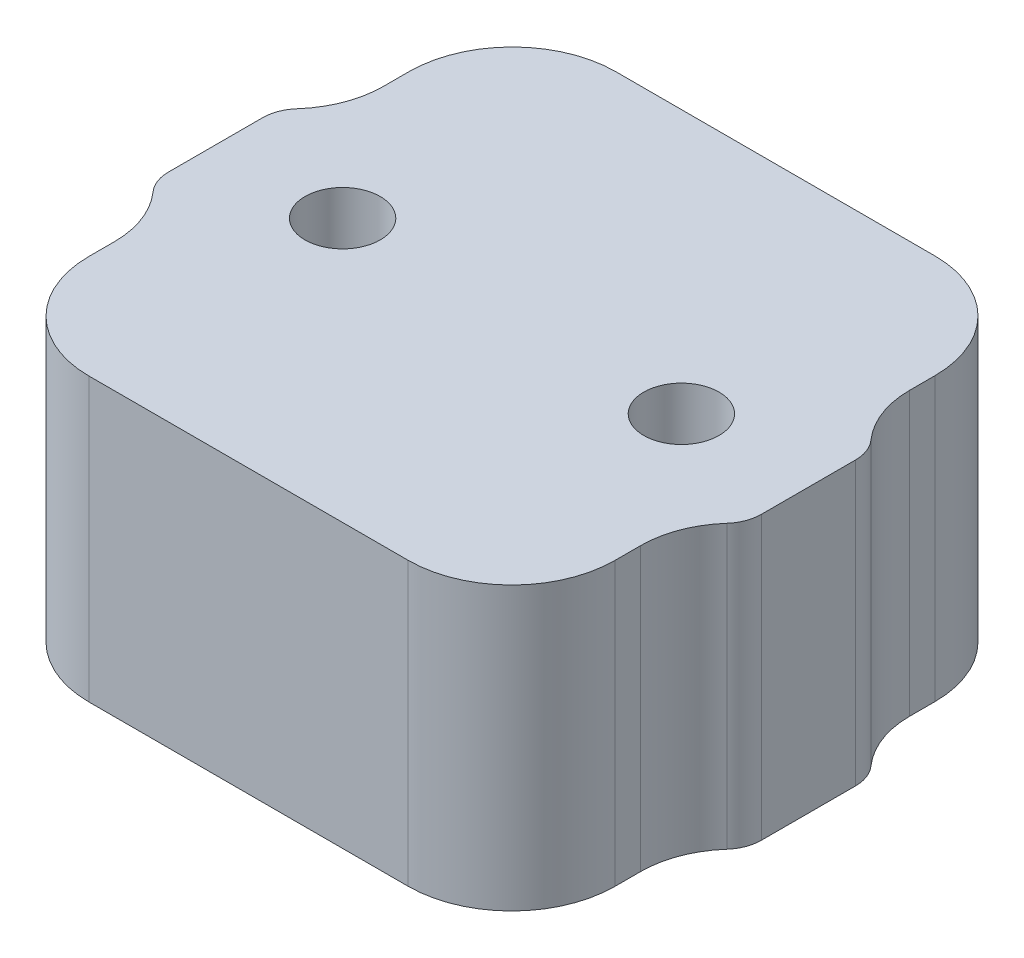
from build123d import *

# Parameters (mm, degrees)
BOSS_EXTRUDE1_DEPTH = 3
SKETCH2_R           = 0.4
CUT_EXTRUDE1_DEPTH  = 46.461261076


with BuildPart() as part:
    # Sketch1 → Boss-Extrude1 (new body)
    with BuildSketch(Plane(origin=(0, 0, 0), x_dir=(1, 0, 0), z_dir=(0, 1, 0))):
        with BuildLine():
            Line((-37.279774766, 16.826390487), (-40.672200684, 16.826390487))
            ThreePointArc((-40.672200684, 16.826390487), (-41.449938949, 16.504287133), (-41.772200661, 15.726614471))
            Line((-41.772200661, 15.726614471), (-41.77225568, 15.456414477))
            ThreePointArc((-41.77225568, 15.456414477), (-41.837590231, 15.101089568), (-42.024921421, 14.792169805))
            ThreePointArc((-42.024921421, 14.792169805), (-42.099868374, 14.668563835), (-42.125987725, 14.526390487))
            Line((-42.125987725, 14.526390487), (-42.125987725, 13.526390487))
            ThreePointArc((-42.125987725, 13.526390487), (-42.099868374, 13.384217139), (-42.024921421, 13.260611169))
            ThreePointArc((-42.024921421, 13.260611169), (-41.837590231, 12.951691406), (-41.77225568, 12.596366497))
            Line((-41.77225568, 12.596366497), (-41.772200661, 12.326166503))
            ThreePointArc((-41.772200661, 12.326166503), (-41.449938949, 11.548493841), (-40.672200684, 11.226390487))
            Line((-40.672200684, 11.226390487), (-37.279774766, 11.226390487))
            ThreePointArc((-37.279774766, 11.226390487), (-36.502036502, 11.548493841), (-36.179774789, 12.326166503))
            Line((-36.179774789, 12.326166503), (-36.179719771, 12.596366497))
            ThreePointArc((-36.179719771, 12.596366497), (-36.11438522, 12.951691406), (-35.92705403, 13.260611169))
            ThreePointArc((-35.92705403, 13.260611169), (-35.852107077, 13.384217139), (-35.825987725, 13.526390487))
            Line((-35.825987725, 13.526390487), (-35.825987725, 14.526390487))
            ThreePointArc((-35.825987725, 14.526390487), (-35.852107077, 14.668563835), (-35.92705403, 14.792169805))
            ThreePointArc((-35.92705403, 14.792169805), (-36.11438522, 15.101089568), (-36.179719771, 15.456414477))
            Line((-36.179719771, 15.456414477), (-36.179774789, 15.726614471))
            ThreePointArc((-36.179774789, 15.726614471), (-36.502036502, 16.504287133), (-37.279774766, 16.826390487))
        make_face()
    extrude(amount=BOSS_EXTRUDE1_DEPTH)

    # Sketch2 → Cut-Extrude1 (cut, through all)
    with BuildSketch(Plane(origin=(0, 3, 0), x_dir=(1, 0, 0), z_dir=(0, 1, 0))):
        with Locations(Location((-40.775987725, 14.026390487, 0), (0, 0, 270))):
            Circle(SKETCH2_R)
        with Locations(Location((-37.175987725, 14.026390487, 0), (0, 0, 90))):
            Circle(SKETCH2_R)
    extrude(amount=-CUT_EXTRUDE1_DEPTH, mode=Mode.SUBTRACT)


solid = part.part
